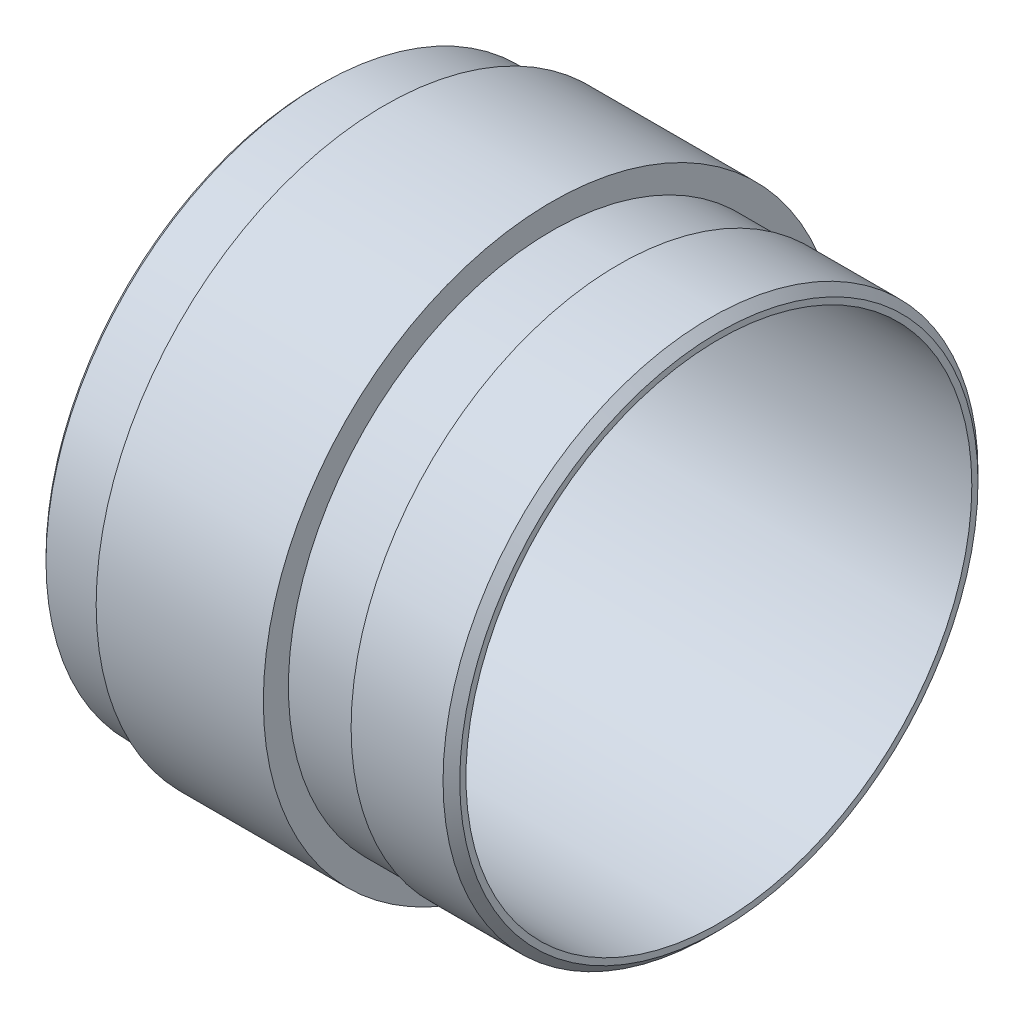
ISO-10303-21;
HEADER;
FILE_DESCRIPTION(('STEP AP214'),'2;1');
FILE_NAME('part.step','',(''),(''),'','','');
FILE_SCHEMA(('AUTOMOTIVE_DESIGN { 1 0 10303 214 1 1 1 1 }'));
ENDSEC;
DATA;
#1=APPLICATION_CONTEXT('core data for automotive mechanical design processes');
#2=APPLICATION_PROTOCOL_DEFINITION('international standard','automotive_design',2000,#1);
#3=PRODUCT_CONTEXT('',#1,'mechanical');
#4=PRODUCT('Part','Part','',(#3));
#5=PRODUCT_RELATED_PRODUCT_CATEGORY('part','',(#4));
#6=PRODUCT_DEFINITION_FORMATION('','',#4);
#7=PRODUCT_DEFINITION_CONTEXT('part definition',#1,'design');
#8=PRODUCT_DEFINITION('design','',#6,#7);
#9=PRODUCT_DEFINITION_SHAPE('','',#8);
#10=(LENGTH_UNIT() NAMED_UNIT(*) SI_UNIT(.MILLI.,.METRE.));
#11=(NAMED_UNIT(*) PLANE_ANGLE_UNIT() SI_UNIT($,.RADIAN.));
#12=(NAMED_UNIT(*) SI_UNIT($,.STERADIAN.) SOLID_ANGLE_UNIT());
#13=UNCERTAINTY_MEASURE_WITH_UNIT(LENGTH_MEASURE(1.E-05),#10,'distance_accuracy_value','');
#14=(GEOMETRIC_REPRESENTATION_CONTEXT(3) GLOBAL_UNCERTAINTY_ASSIGNED_CONTEXT((#13)) GLOBAL_UNIT_ASSIGNED_CONTEXT((#10,
#11,#12)) REPRESENTATION_CONTEXT('',''));
#15=CARTESIAN_POINT('',(0.,0.,0.));
#16=DIRECTION('',(0.,0.,1.));
#17=DIRECTION('',(1.,0.,0.));
#18=AXIS2_PLACEMENT_3D('',#15,#16,#17);
#19=CARTESIAN_POINT('',(152.4,0.,0.));
#20=DIRECTION('',(-1.,0.,0.));
#21=DIRECTION('',(0.,0.,1.));
#22=AXIS2_PLACEMENT_3D('',#19,#20,#21);
#23=CYLINDRICAL_SURFACE('',#22,109.5375);
#24=CARTESIAN_POINT('',(88.9000000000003,0.,0.));
#25=DIRECTION('',(-1.,0.,0.));
#26=DIRECTION('',(0.,0.,1.));
#27=AXIS2_PLACEMENT_3D('',#24,#25,#26);
#28=CIRCLE('',#27,109.5375);
#29=CARTESIAN_POINT('',(88.9000000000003,0.,109.5375));
#30=VERTEX_POINT('',#29);
#31=EDGE_CURVE('E60',#30,#30,#28,.T.);
#32=ORIENTED_EDGE('',*,*,#31,.T.);
#33=EDGE_LOOP('',(#32));
#34=FACE_BOUND('',#33,.T.);
#35=CARTESIAN_POINT('',(25.4000000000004,0.,0.));
#36=DIRECTION('',(-1.,0.,0.));
#37=DIRECTION('',(0.,0.,1.));
#38=AXIS2_PLACEMENT_3D('',#35,#36,#37);
#39=CIRCLE('',#38,109.5375);
#40=CARTESIAN_POINT('',(25.4000000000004,0.,109.5375));
#41=VERTEX_POINT('',#40);
#42=EDGE_CURVE('E46',#41,#41,#39,.T.);
#43=ORIENTED_EDGE('',*,*,#42,.F.);
#44=EDGE_LOOP('',(#43));
#45=FACE_BOUND('',#44,.T.);
#46=ADVANCED_FACE('F42',(#34,#45),#23,.T.);
#47=CARTESIAN_POINT('',(152.4,0.,0.));
#48=DIRECTION('',(1.,0.,0.));
#49=DIRECTION('',(0.,0.,-1.));
#50=AXIS2_PLACEMENT_3D('',#47,#48,#49);
#51=PLANE('',#50);
#52=CARTESIAN_POINT('',(152.4,0.,0.));
#53=DIRECTION('',(1.,0.,0.));
#54=DIRECTION('',(0.,0.,-1.));
#55=AXIS2_PLACEMENT_3D('',#52,#53,#54);
#56=CIRCLE('',#55,98.4249999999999);
#57=CARTESIAN_POINT('',(152.4,0.,-98.4249999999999));
#58=VERTEX_POINT('',#57);
#59=EDGE_CURVE('E50',#58,#58,#56,.T.);
#60=ORIENTED_EDGE('',*,*,#59,.T.);
#61=EDGE_LOOP('',(#60));
#62=FACE_BOUND('',#61,.T.);
#63=CARTESIAN_POINT('',(152.4,0.,0.));
#64=DIRECTION('',(1.,0.,0.));
#65=DIRECTION('',(0.,0.,-1.));
#66=AXIS2_PLACEMENT_3D('',#63,#64,#65);
#67=CIRCLE('',#66,96.0755);
#68=CARTESIAN_POINT('',(152.4,0.,-96.0755));
#69=VERTEX_POINT('',#68);
#70=EDGE_CURVE('E77',#69,#69,#67,.T.);
#71=ORIENTED_EDGE('',*,*,#70,.F.);
#72=EDGE_LOOP('',(#71));
#73=FACE_BOUND('',#72,.T.);
#74=ADVANCED_FACE('F100',(#62,#73),#51,.T.);
#75=CARTESIAN_POINT('',(0.,0.,0.));
#76=DIRECTION('',(1.,0.,0.));
#77=DIRECTION('',(0.,0.,-1.));
#78=AXIS2_PLACEMENT_3D('',#75,#76,#77);
#79=PLANE('',#78);
#80=CARTESIAN_POINT('',(0.,0.,0.));
#81=DIRECTION('',(1.,0.,0.));
#82=DIRECTION('',(0.,0.,-1.));
#83=AXIS2_PLACEMENT_3D('',#80,#81,#82);
#84=CIRCLE('',#83,103.1875);
#85=CARTESIAN_POINT('',(0.,0.,-103.1875));
#86=VERTEX_POINT('',#85);
#87=EDGE_CURVE('E80',#86,#86,#84,.F.);
#88=ORIENTED_EDGE('',*,*,#87,.T.);
#89=EDGE_LOOP('',(#88));
#90=FACE_BOUND('',#89,.T.);
#91=CARTESIAN_POINT('',(0.,0.,0.));
#92=DIRECTION('',(1.,0.,0.));
#93=DIRECTION('',(0.,0.,-1.));
#94=AXIS2_PLACEMENT_3D('',#91,#92,#93);
#95=CIRCLE('',#94,96.0755);
#96=CARTESIAN_POINT('',(0.,0.,-96.0755));
#97=VERTEX_POINT('',#96);
#98=EDGE_CURVE('E65',#97,#97,#95,.T.);
#99=ORIENTED_EDGE('',*,*,#98,.T.);
#100=EDGE_LOOP('',(#99));
#101=FACE_BOUND('',#100,.T.);
#102=ADVANCED_FACE('F96',(#90,#101),#79,.F.);
#103=CARTESIAN_POINT('',(152.4,0.,0.));
#104=DIRECTION('',(-1.,0.,0.));
#105=DIRECTION('',(0.,0.,1.));
#106=AXIS2_PLACEMENT_3D('',#103,#104,#105);
#107=CYLINDRICAL_SURFACE('',#106,96.0755);
#108=ORIENTED_EDGE('',*,*,#70,.T.);
#109=EDGE_LOOP('',(#108));
#110=FACE_BOUND('',#109,.T.);
#111=ORIENTED_EDGE('',*,*,#98,.F.);
#112=EDGE_LOOP('',(#111));
#113=FACE_BOUND('',#112,.T.);
#114=ADVANCED_FACE('F99',(#110,#113),#107,.F.);
#115=CARTESIAN_POINT('',(88.9000000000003,0.,-113.961302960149));
#116=DIRECTION('',(-1.,0.,0.));
#117=DIRECTION('',(0.,0.,1.));
#118=AXIS2_PLACEMENT_3D('',#115,#116,#117);
#119=PLANE('',#118);
#120=ORIENTED_EDGE('',*,*,#31,.F.);
#121=EDGE_LOOP('',(#120));
#122=FACE_BOUND('',#121,.T.);
#123=CARTESIAN_POINT('',(88.9000000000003,0.,0.));
#124=DIRECTION('',(1.,0.,0.));
#125=DIRECTION('',(0.,0.,-1.));
#126=AXIS2_PLACEMENT_3D('',#123,#124,#125);
#127=CIRCLE('',#126,100.0125);
#128=CARTESIAN_POINT('',(88.9000000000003,0.,-100.0125));
#129=VERTEX_POINT('',#128);
#130=EDGE_CURVE('E68',#129,#129,#127,.T.);
#131=ORIENTED_EDGE('',*,*,#130,.F.);
#132=EDGE_LOOP('',(#131));
#133=FACE_BOUND('',#132,.T.);
#134=ADVANCED_FACE('F105',(#122,#133),#119,.F.);
#135=CARTESIAN_POINT('',(12.7000000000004,0.,0.));
#136=DIRECTION('',(-1.,0.,0.));
#137=DIRECTION('',(0.,0.,1.));
#138=AXIS2_PLACEMENT_3D('',#135,#136,#137);
#139=CYLINDRICAL_SURFACE('',#138,104.775);
#140=CARTESIAN_POINT('',(1.58750000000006,0.,0.));
#141=DIRECTION('',(1.,0.,0.));
#142=DIRECTION('',(0.,0.,-1.));
#143=AXIS2_PLACEMENT_3D('',#140,#141,#142);
#144=CIRCLE('',#143,104.775);
#145=CARTESIAN_POINT('',(1.58750000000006,0.,-104.775));
#146=VERTEX_POINT('',#145);
#147=EDGE_CURVE('E55',#146,#146,#144,.T.);
#148=ORIENTED_EDGE('',*,*,#147,.T.);
#149=EDGE_LOOP('',(#148));
#150=FACE_BOUND('',#149,.T.);
#151=CARTESIAN_POINT('',(25.4000000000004,0.,0.));
#152=DIRECTION('',(-1.,0.,0.));
#153=DIRECTION('',(0.,0.,1.));
#154=AXIS2_PLACEMENT_3D('',#151,#152,#153);
#155=CIRCLE('',#154,104.775);
#156=CARTESIAN_POINT('',(25.4000000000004,0.,104.775));
#157=VERTEX_POINT('',#156);
#158=EDGE_CURVE('E75',#157,#157,#155,.T.);
#159=ORIENTED_EDGE('',*,*,#158,.T.);
#160=EDGE_LOOP('',(#159));
#161=FACE_BOUND('',#160,.T.);
#162=ADVANCED_FACE('F87',(#150,#161),#139,.T.);
#163=CARTESIAN_POINT('',(0.,0.,0.));
#164=DIRECTION('',(1.,0.,0.));
#165=DIRECTION('',(0.,0.,-1.));
#166=AXIS2_PLACEMENT_3D('',#163,#164,#165);
#167=CONICAL_SURFACE('',#166,103.1875,0.785398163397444);
#168=ORIENTED_EDGE('',*,*,#147,.F.);
#169=EDGE_LOOP('',(#168));
#170=FACE_BOUND('',#169,.T.);
#171=ORIENTED_EDGE('',*,*,#87,.F.);
#172=EDGE_LOOP('',(#171));
#173=FACE_BOUND('',#172,.T.);
#174=ADVANCED_FACE('F90',(#170,#173),#167,.T.);
#175=CARTESIAN_POINT('',(-259.712499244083,0.,0.));
#176=DIRECTION('',(1.,0.,0.));
#177=DIRECTION('',(0.,0.,-1.));
#178=AXIS2_PLACEMENT_3D('',#175,#176,#177);
#179=CYLINDRICAL_SURFACE('',#178,101.6);
#180=CARTESIAN_POINT('',(114.3,0.,0.));
#181=DIRECTION('',(1.,0.,0.));
#182=DIRECTION('',(0.,0.,-1.));
#183=AXIS2_PLACEMENT_3D('',#180,#181,#182);
#184=CIRCLE('',#183,101.6);
#185=CARTESIAN_POINT('',(114.3,0.,-101.6));
#186=VERTEX_POINT('',#185);
#187=EDGE_CURVE('E58',#186,#186,#184,.F.);
#188=ORIENTED_EDGE('',*,*,#187,.F.);
#189=EDGE_LOOP('',(#188));
#190=FACE_BOUND('',#189,.T.);
#191=CARTESIAN_POINT('',(149.225,0.,0.));
#192=DIRECTION('',(1.,0.,0.));
#193=DIRECTION('',(0.,0.,-1.));
#194=AXIS2_PLACEMENT_3D('',#191,#192,#193);
#195=CIRCLE('',#194,101.6);
#196=CARTESIAN_POINT('',(149.225,0.,-101.6));
#197=VERTEX_POINT('',#196);
#198=EDGE_CURVE('E10',#197,#197,#195,.F.);
#199=ORIENTED_EDGE('',*,*,#198,.T.);
#200=EDGE_LOOP('',(#199));
#201=FACE_BOUND('',#200,.T.);
#202=ADVANCED_FACE('F93',(#190,#201),#179,.T.);
#203=CARTESIAN_POINT('',(152.4,0.,0.));
#204=DIRECTION('',(-1.,0.,0.));
#205=DIRECTION('',(0.,0.,1.));
#206=AXIS2_PLACEMENT_3D('',#203,#204,#205);
#207=CONICAL_SURFACE('',#206,98.4249999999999,0.785398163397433);
#208=ORIENTED_EDGE('',*,*,#198,.F.);
#209=EDGE_LOOP('',(#208));
#210=FACE_BOUND('',#209,.T.);
#211=ORIENTED_EDGE('',*,*,#59,.F.);
#212=EDGE_LOOP('',(#211));
#213=FACE_BOUND('',#212,.T.);
#214=ADVANCED_FACE('F44',(#210,#213),#207,.T.);
#215=CARTESIAN_POINT('',(114.3,0.,0.));
#216=DIRECTION('',(1.,0.,0.));
#217=DIRECTION('',(0.,0.,-1.));
#218=AXIS2_PLACEMENT_3D('',#215,#216,#217);
#219=PLANE('',#218);
#220=ORIENTED_EDGE('',*,*,#187,.T.);
#221=EDGE_LOOP('',(#220));
#222=FACE_BOUND('',#221,.T.);
#223=CARTESIAN_POINT('',(114.3,0.,0.));
#224=DIRECTION('',(1.,0.,0.));
#225=DIRECTION('',(0.,0.,-1.));
#226=AXIS2_PLACEMENT_3D('',#223,#224,#225);
#227=CIRCLE('',#226,100.0125);
#228=CARTESIAN_POINT('',(114.3,0.,-100.0125));
#229=VERTEX_POINT('',#228);
#230=EDGE_CURVE('E61',#229,#229,#227,.T.);
#231=ORIENTED_EDGE('',*,*,#230,.T.);
#232=EDGE_LOOP('',(#231));
#233=FACE_BOUND('',#232,.T.);
#234=ADVANCED_FACE('F136',(#222,#233),#219,.F.);
#235=CARTESIAN_POINT('',(114.3,0.,0.));
#236=DIRECTION('',(-1.,0.,0.));
#237=DIRECTION('',(0.,0.,1.));
#238=AXIS2_PLACEMENT_3D('',#235,#236,#237);
#239=CYLINDRICAL_SURFACE('',#238,100.0125);
#240=ORIENTED_EDGE('',*,*,#230,.F.);
#241=EDGE_LOOP('',(#240));
#242=FACE_BOUND('',#241,.T.);
#243=ORIENTED_EDGE('',*,*,#130,.T.);
#244=EDGE_LOOP('',(#243));
#245=FACE_BOUND('',#244,.T.);
#246=ADVANCED_FACE('F131',(#242,#245),#239,.T.);
#247=CARTESIAN_POINT('',(25.4000000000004,0.,0.));
#248=DIRECTION('',(-1.,0.,0.));
#249=DIRECTION('',(0.,0.,1.));
#250=AXIS2_PLACEMENT_3D('',#247,#248,#249);
#251=PLANE('',#250);
#252=ORIENTED_EDGE('',*,*,#158,.F.);
#253=EDGE_LOOP('',(#252));
#254=FACE_BOUND('',#253,.T.);
#255=ORIENTED_EDGE('',*,*,#42,.T.);
#256=EDGE_LOOP('',(#255));
#257=FACE_BOUND('',#256,.T.);
#258=ADVANCED_FACE('F129',(#254,#257),#251,.T.);
#259=CLOSED_SHELL('',(#46,#74,#102,#114,#134,#162,#174,#202,#214,#234,#246,#258));
#260=MANIFOLD_SOLID_BREP('B2',#259);
#261=ADVANCED_BREP_SHAPE_REPRESENTATION('',(#18,#260),#14);
#262=SHAPE_DEFINITION_REPRESENTATION(#9,#261);
ENDSEC;
END-ISO-10303-21;
